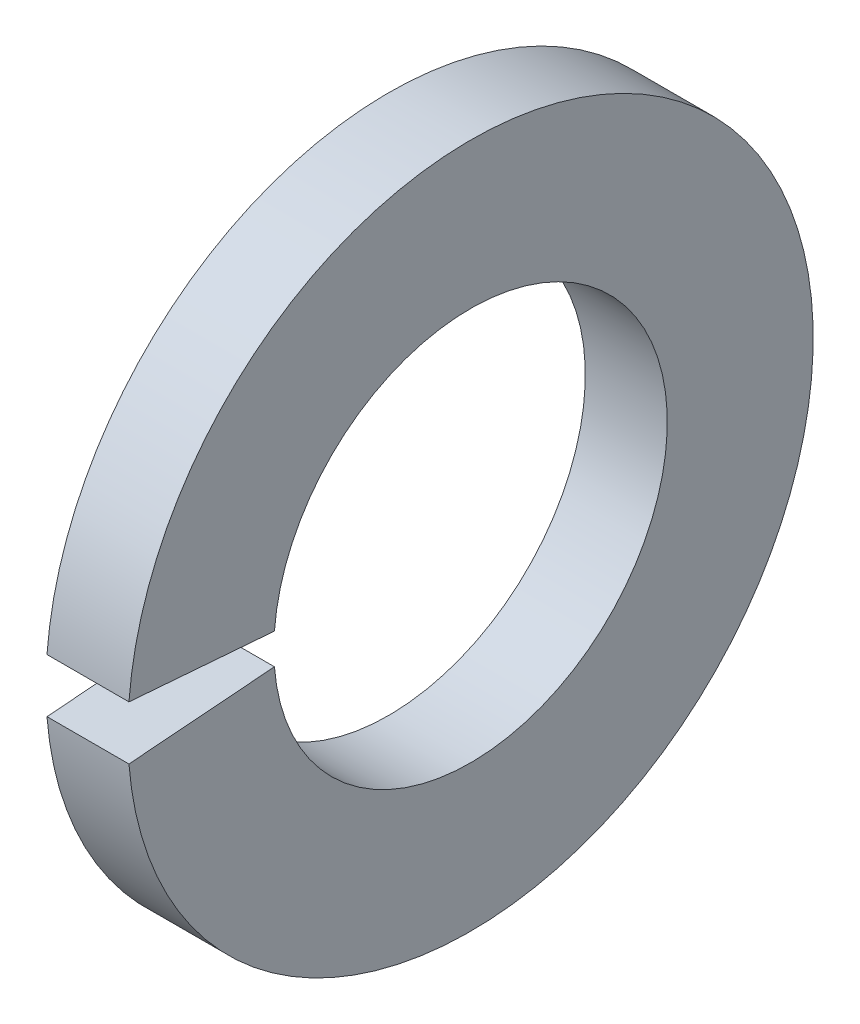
from build123d import *

# Parameters (mm, degrees)
SKETCH1_W = 0.635
SKETCH1_H = 1.1303
GAP_DEPTH = 4.807077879


with BuildPart() as part:
    # Sketch1 → Base-Revolve (revolve)
    with BuildSketch(Plane.XY, mode=Mode.PRIVATE) as base_revolve_sk:
        with Locations((-0.3175, 2.08915)):
            Rectangle(SKETCH1_W, SKETCH1_H)
    revolve(base_revolve_sk.sketch.rotate(Axis((-34.925, 0, 0), (1, 0, 0)), 90), axis=Axis((-34.925, 0, 0), (1, 0, 0)))

    # Sketch2 → Gap (cut, through all)
    with BuildSketch(Plane(origin=(0, 0, 0), x_dir=(0, -1, 0), z_dir=(-1, 0, 0))):
        with BuildLine():
            Line((0, 0), (0.212419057, 2.699040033))
            ThreePointArc((0.212419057, 2.699040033), (0, 2.707386), (-0.212419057, 2.699040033))
            Line((-0.212419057, 2.699040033), (0, 0))
        make_face()
    extrude(amount=GAP_DEPTH, mode=Mode.SUBTRACT)


solid = part.part
